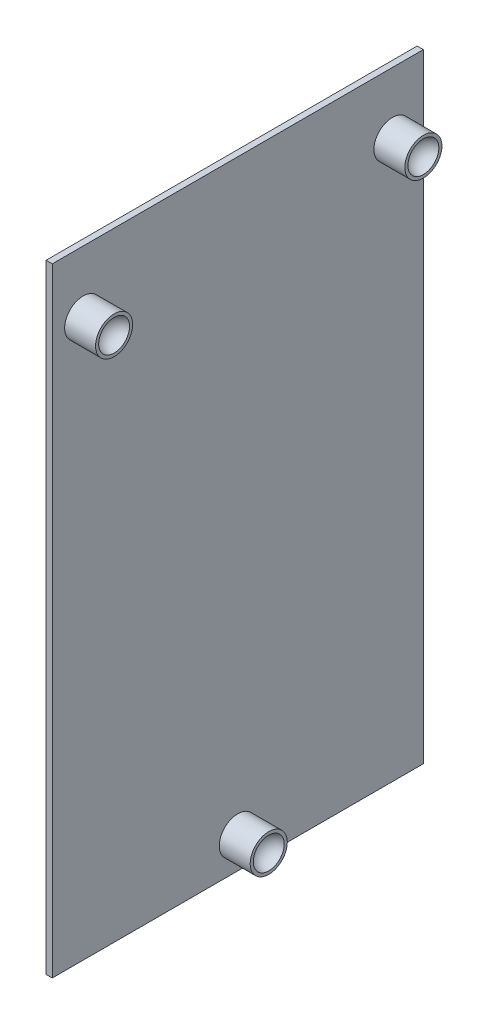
ISO-10303-21;
HEADER;
FILE_DESCRIPTION(('STEP AP214'),'2;1');
FILE_NAME('part.step','',(''),(''),'','','');
FILE_SCHEMA(('AUTOMOTIVE_DESIGN { 1 0 10303 214 1 1 1 1 }'));
ENDSEC;
DATA;
#1=APPLICATION_CONTEXT('core data for automotive mechanical design processes');
#2=APPLICATION_PROTOCOL_DEFINITION('international standard','automotive_design',2000,#1);
#3=PRODUCT_CONTEXT('',#1,'mechanical');
#4=PRODUCT('Part','Part','',(#3));
#5=PRODUCT_RELATED_PRODUCT_CATEGORY('part','',(#4));
#6=PRODUCT_DEFINITION_FORMATION('','',#4);
#7=PRODUCT_DEFINITION_CONTEXT('part definition',#1,'design');
#8=PRODUCT_DEFINITION('design','',#6,#7);
#9=PRODUCT_DEFINITION_SHAPE('','',#8);
#10=(LENGTH_UNIT() NAMED_UNIT(*) SI_UNIT(.MILLI.,.METRE.));
#11=(NAMED_UNIT(*) PLANE_ANGLE_UNIT() SI_UNIT($,.RADIAN.));
#12=(NAMED_UNIT(*) SI_UNIT($,.STERADIAN.) SOLID_ANGLE_UNIT());
#13=UNCERTAINTY_MEASURE_WITH_UNIT(LENGTH_MEASURE(1.E-05),#10,'distance_accuracy_value','');
#14=(GEOMETRIC_REPRESENTATION_CONTEXT(3) GLOBAL_UNCERTAINTY_ASSIGNED_CONTEXT((#13)) GLOBAL_UNIT_ASSIGNED_CONTEXT((#10,
#11,#12)) REPRESENTATION_CONTEXT('',''));
#15=CARTESIAN_POINT('',(0.,0.,0.));
#16=DIRECTION('',(0.,0.,1.));
#17=DIRECTION('',(1.,0.,0.));
#18=AXIS2_PLACEMENT_3D('',#15,#16,#17);
#19=CARTESIAN_POINT('',(-20.,2000.,600.));
#20=DIRECTION('',(0.,0.,1.));
#21=DIRECTION('',(0.,-1.,0.));
#22=AXIS2_PLACEMENT_3D('',#19,#20,#21);
#23=PLANE('',#22);
#24=DIRECTION('',(0.,-1.,0.));
#25=VECTOR('',#24,1.);
#26=CARTESIAN_POINT('',(0.,2000.,600.));
#27=LINE('',#26,#25);
#28=CARTESIAN_POINT('',(0.,2000.,600.));
#29=VERTEX_POINT('',#28);
#30=CARTESIAN_POINT('',(0.,0.,600.));
#31=VERTEX_POINT('',#30);
#32=EDGE_CURVE('E100',#29,#31,#27,.T.);
#33=ORIENTED_EDGE('',*,*,#32,.F.);
#34=DIRECTION('',(1.,0.,0.));
#35=VECTOR('',#34,1.);
#36=CARTESIAN_POINT('',(-20.,2000.,600.));
#37=LINE('',#36,#35);
#38=CARTESIAN_POINT('',(-20.,2000.,600.));
#39=VERTEX_POINT('',#38);
#40=EDGE_CURVE('E48',#39,#29,#37,.T.);
#41=ORIENTED_EDGE('',*,*,#40,.F.);
#42=DIRECTION('',(0.,-1.,0.));
#43=VECTOR('',#42,1.);
#44=CARTESIAN_POINT('',(-20.,2000.,600.));
#45=LINE('',#44,#43);
#46=CARTESIAN_POINT('',(-20.,0.,600.));
#47=VERTEX_POINT('',#46);
#48=EDGE_CURVE('E93',#39,#47,#45,.T.);
#49=ORIENTED_EDGE('',*,*,#48,.T.);
#50=DIRECTION('',(1.,0.,0.));
#51=VECTOR('',#50,1.);
#52=CARTESIAN_POINT('',(-20.,0.,600.));
#53=LINE('',#52,#51);
#54=EDGE_CURVE('E76',#47,#31,#53,.T.);
#55=ORIENTED_EDGE('',*,*,#54,.T.);
#56=EDGE_LOOP('',(#33,#41,#49,#55));
#57=FACE_BOUND('',#56,.T.);
#58=ADVANCED_FACE('F32',(#57),#23,.T.);
#59=CARTESIAN_POINT('',(-20.,2000.,600.));
#60=DIRECTION('',(0.,1.,0.));
#61=DIRECTION('',(0.,0.,1.));
#62=AXIS2_PLACEMENT_3D('',#59,#60,#61);
#63=PLANE('',#62);
#64=DIRECTION('',(0.,0.,1.));
#65=VECTOR('',#64,1.);
#66=CARTESIAN_POINT('',(0.,2000.,600.));
#67=LINE('',#66,#65);
#68=CARTESIAN_POINT('',(0.,2000.,-600.));
#69=VERTEX_POINT('',#68);
#70=EDGE_CURVE('E95',#69,#29,#67,.T.);
#71=ORIENTED_EDGE('',*,*,#70,.F.);
#72=DIRECTION('',(1.,0.,0.));
#73=VECTOR('',#72,1.);
#74=CARTESIAN_POINT('',(-20.,2000.,-600.));
#75=LINE('',#74,#73);
#76=CARTESIAN_POINT('',(-20.,2000.,-600.));
#77=VERTEX_POINT('',#76);
#78=EDGE_CURVE('E65',#77,#69,#75,.T.);
#79=ORIENTED_EDGE('',*,*,#78,.F.);
#80=DIRECTION('',(0.,0.,1.));
#81=VECTOR('',#80,1.);
#82=CARTESIAN_POINT('',(-20.,2000.,600.));
#83=LINE('',#82,#81);
#84=EDGE_CURVE('E90',#77,#39,#83,.T.);
#85=ORIENTED_EDGE('',*,*,#84,.T.);
#86=ORIENTED_EDGE('',*,*,#40,.T.);
#87=EDGE_LOOP('',(#71,#79,#85,#86));
#88=FACE_BOUND('',#87,.T.);
#89=ADVANCED_FACE('F127',(#88),#63,.T.);
#90=CARTESIAN_POINT('',(-20.,2000.,-600.));
#91=DIRECTION('',(0.,0.,-1.));
#92=DIRECTION('',(0.,1.,0.));
#93=AXIS2_PLACEMENT_3D('',#90,#91,#92);
#94=PLANE('',#93);
#95=DIRECTION('',(0.,1.,0.));
#96=VECTOR('',#95,1.);
#97=CARTESIAN_POINT('',(0.,2000.,-600.));
#98=LINE('',#97,#96);
#99=CARTESIAN_POINT('',(0.,0.,-600.));
#100=VERTEX_POINT('',#99);
#101=EDGE_CURVE('E84',#100,#69,#98,.T.);
#102=ORIENTED_EDGE('',*,*,#101,.F.);
#103=DIRECTION('',(1.,0.,0.));
#104=VECTOR('',#103,1.);
#105=CARTESIAN_POINT('',(-20.,0.,-600.));
#106=LINE('',#105,#104);
#107=CARTESIAN_POINT('',(-20.,0.,-600.));
#108=VERTEX_POINT('',#107);
#109=EDGE_CURVE('E79',#108,#100,#106,.T.);
#110=ORIENTED_EDGE('',*,*,#109,.F.);
#111=DIRECTION('',(0.,1.,0.));
#112=VECTOR('',#111,1.);
#113=CARTESIAN_POINT('',(-20.,2000.,-600.));
#114=LINE('',#113,#112);
#115=EDGE_CURVE('E82',#108,#77,#114,.T.);
#116=ORIENTED_EDGE('',*,*,#115,.T.);
#117=ORIENTED_EDGE('',*,*,#78,.T.);
#118=EDGE_LOOP('',(#102,#110,#116,#117));
#119=FACE_BOUND('',#118,.T.);
#120=ADVANCED_FACE('F81',(#119),#94,.T.);
#121=CARTESIAN_POINT('',(-20.,0.,600.));
#122=DIRECTION('',(0.,-1.,0.));
#123=DIRECTION('',(0.,0.,-1.));
#124=AXIS2_PLACEMENT_3D('',#121,#122,#123);
#125=PLANE('',#124);
#126=DIRECTION('',(0.,0.,-1.));
#127=VECTOR('',#126,1.);
#128=CARTESIAN_POINT('',(0.,0.,600.));
#129=LINE('',#128,#127);
#130=EDGE_CURVE('E103',#31,#100,#129,.T.);
#131=ORIENTED_EDGE('',*,*,#130,.F.);
#132=ORIENTED_EDGE('',*,*,#54,.F.);
#133=DIRECTION('',(0.,0.,-1.));
#134=VECTOR('',#133,1.);
#135=CARTESIAN_POINT('',(-20.,0.,600.));
#136=LINE('',#135,#134);
#137=EDGE_CURVE('E89',#47,#108,#136,.T.);
#138=ORIENTED_EDGE('',*,*,#137,.T.);
#139=ORIENTED_EDGE('',*,*,#109,.T.);
#140=EDGE_LOOP('',(#131,#132,#138,#139));
#141=FACE_BOUND('',#140,.T.);
#142=ADVANCED_FACE('F92',(#141),#125,.T.);
#143=CARTESIAN_POINT('',(-20.,0.,0.));
#144=DIRECTION('',(1.,0.,0.));
#145=DIRECTION('',(0.,0.,-1.));
#146=AXIS2_PLACEMENT_3D('',#143,#144,#145);
#147=PLANE('',#146);
#148=ORIENTED_EDGE('',*,*,#48,.F.);
#149=ORIENTED_EDGE('',*,*,#84,.F.);
#150=ORIENTED_EDGE('',*,*,#115,.F.);
#151=ORIENTED_EDGE('',*,*,#137,.F.);
#152=EDGE_LOOP('',(#148,#149,#150,#151));
#153=FACE_BOUND('',#152,.T.);
#154=ADVANCED_FACE('F88',(#153),#147,.F.);
#155=CARTESIAN_POINT('',(0.,0.,0.));
#156=DIRECTION('',(1.,0.,0.));
#157=DIRECTION('',(0.,0.,-1.));
#158=AXIS2_PLACEMENT_3D('',#155,#156,#157);
#159=PLANE('',#158);
#160=CARTESIAN_POINT('',(0.,1800.,-500.));
#161=DIRECTION('',(1.,0.,0.));
#162=DIRECTION('',(0.,0.,-1.));
#163=AXIS2_PLACEMENT_3D('',#160,#161,#162);
#164=CIRCLE('',#163,60.0000000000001);
#165=CARTESIAN_POINT('',(0.,1800.,-560.));
#166=VERTEX_POINT('',#165);
#167=EDGE_CURVE('E11',#166,#166,#164,.T.);
#168=ORIENTED_EDGE('',*,*,#167,.F.);
#169=EDGE_LOOP('',(#168));
#170=FACE_BOUND('',#169,.T.);
#171=CARTESIAN_POINT('',(0.,1800.,500.));
#172=DIRECTION('',(1.,0.,0.));
#173=DIRECTION('',(0.,0.,-1.));
#174=AXIS2_PLACEMENT_3D('',#171,#172,#173);
#175=CIRCLE('',#174,60.0000000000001);
#176=CARTESIAN_POINT('',(0.,1800.,440.));
#177=VERTEX_POINT('',#176);
#178=EDGE_CURVE('E40',#177,#177,#175,.T.);
#179=ORIENTED_EDGE('',*,*,#178,.F.);
#180=EDGE_LOOP('',(#179));
#181=FACE_BOUND('',#180,.T.);
#182=CARTESIAN_POINT('',(0.,100.,0.));
#183=DIRECTION('',(1.,0.,0.));
#184=DIRECTION('',(0.,0.,-1.));
#185=AXIS2_PLACEMENT_3D('',#182,#183,#184);
#186=CIRCLE('',#185,60.);
#187=CARTESIAN_POINT('',(0.,100.,-60.));
#188=VERTEX_POINT('',#187);
#189=EDGE_CURVE('E110',#188,#188,#186,.T.);
#190=ORIENTED_EDGE('',*,*,#189,.F.);
#191=EDGE_LOOP('',(#190));
#192=FACE_BOUND('',#191,.T.);
#193=ORIENTED_EDGE('',*,*,#32,.T.);
#194=ORIENTED_EDGE('',*,*,#130,.T.);
#195=ORIENTED_EDGE('',*,*,#101,.T.);
#196=ORIENTED_EDGE('',*,*,#70,.T.);
#197=EDGE_LOOP('',(#193,#194,#195,#196));
#198=FACE_BOUND('',#197,.T.);
#199=ADVANCED_FACE('F119',(#170,#181,#192,#198),#159,.T.);
#200=CARTESIAN_POINT('',(0.,100.,0.));
#201=DIRECTION('',(-1.,0.,0.));
#202=DIRECTION('',(0.,-1.,0.));
#203=AXIS2_PLACEMENT_3D('',#200,#201,#202);
#204=CYLINDRICAL_SURFACE('',#203,60.);
#205=CARTESIAN_POINT('',(100.,100.,0.));
#206=DIRECTION('',(-1.,0.,0.));
#207=DIRECTION('',(0.,-1.,0.));
#208=AXIS2_PLACEMENT_3D('',#205,#206,#207);
#209=CIRCLE('',#208,60.);
#210=CARTESIAN_POINT('',(100.,40.,0.));
#211=VERTEX_POINT('',#210);
#212=EDGE_CURVE('E104',#211,#211,#209,.T.);
#213=ORIENTED_EDGE('',*,*,#212,.T.);
#214=EDGE_LOOP('',(#213));
#215=FACE_BOUND('',#214,.T.);
#216=ORIENTED_EDGE('',*,*,#189,.T.);
#217=EDGE_LOOP('',(#216));
#218=FACE_BOUND('',#217,.T.);
#219=ADVANCED_FACE('F122',(#215,#218),#204,.T.);
#220=CARTESIAN_POINT('',(100.,50.,0.));
#221=DIRECTION('',(1.,0.,0.));
#222=DIRECTION('',(0.,1.,0.));
#223=AXIS2_PLACEMENT_3D('',#220,#221,#222);
#224=PLANE('',#223);
#225=CARTESIAN_POINT('',(100.,100.,0.));
#226=DIRECTION('',(-1.,0.,0.));
#227=DIRECTION('',(0.,-1.,0.));
#228=AXIS2_PLACEMENT_3D('',#225,#226,#227);
#229=CIRCLE('',#228,50.);
#230=CARTESIAN_POINT('',(100.,50.,0.));
#231=VERTEX_POINT('',#230);
#232=EDGE_CURVE('E192',#231,#231,#229,.T.);
#233=ORIENTED_EDGE('',*,*,#232,.T.);
#234=EDGE_LOOP('',(#233));
#235=FACE_BOUND('',#234,.T.);
#236=ORIENTED_EDGE('',*,*,#212,.F.);
#237=EDGE_LOOP('',(#236));
#238=FACE_BOUND('',#237,.T.);
#239=ADVANCED_FACE('F145',(#235,#238),#224,.T.);
#240=CARTESIAN_POINT('',(100.,100.,0.));
#241=DIRECTION('',(-1.,0.,0.));
#242=DIRECTION('',(0.,-1.,0.));
#243=AXIS2_PLACEMENT_3D('',#240,#241,#242);
#244=SPHERICAL_SURFACE('',#243,50.);
#245=ORIENTED_EDGE('',*,*,#232,.F.);
#246=EDGE_LOOP('',(#245));
#247=FACE_BOUND('',#246,.T.);
#248=ADVANCED_FACE('F149',(#247),#244,.F.);
#249=CARTESIAN_POINT('',(0.,1800.,500.));
#250=DIRECTION('',(-1.,0.,0.));
#251=DIRECTION('',(0.,0.,1.));
#252=AXIS2_PLACEMENT_3D('',#249,#250,#251);
#253=CYLINDRICAL_SURFACE('',#252,60.0000000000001);
#254=CARTESIAN_POINT('',(100.,1800.,500.));
#255=DIRECTION('',(-1.,0.,0.));
#256=DIRECTION('',(0.,0.,1.));
#257=AXIS2_PLACEMENT_3D('',#254,#255,#256);
#258=CIRCLE('',#257,60.0000000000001);
#259=CARTESIAN_POINT('',(100.,1800.,560.));
#260=VERTEX_POINT('',#259);
#261=EDGE_CURVE('E189',#260,#260,#258,.T.);
#262=ORIENTED_EDGE('',*,*,#261,.T.);
#263=EDGE_LOOP('',(#262));
#264=FACE_BOUND('',#263,.T.);
#265=ORIENTED_EDGE('',*,*,#178,.T.);
#266=EDGE_LOOP('',(#265));
#267=FACE_BOUND('',#266,.T.);
#268=ADVANCED_FACE('F117',(#264,#267),#253,.T.);
#269=CARTESIAN_POINT('',(100.,1750.,500.));
#270=DIRECTION('',(1.,0.,0.));
#271=DIRECTION('',(0.,0.,-1.));
#272=AXIS2_PLACEMENT_3D('',#269,#270,#271);
#273=PLANE('',#272);
#274=CARTESIAN_POINT('',(100.,1800.,500.));
#275=DIRECTION('',(-1.,0.,0.));
#276=DIRECTION('',(0.,0.,1.));
#277=AXIS2_PLACEMENT_3D('',#274,#275,#276);
#278=CIRCLE('',#277,50.);
#279=CARTESIAN_POINT('',(100.,1800.,550.));
#280=VERTEX_POINT('',#279);
#281=EDGE_CURVE('E184',#280,#280,#278,.T.);
#282=ORIENTED_EDGE('',*,*,#281,.T.);
#283=EDGE_LOOP('',(#282));
#284=FACE_BOUND('',#283,.T.);
#285=ORIENTED_EDGE('',*,*,#261,.F.);
#286=EDGE_LOOP('',(#285));
#287=FACE_BOUND('',#286,.T.);
#288=ADVANCED_FACE('F156',(#284,#287),#273,.T.);
#289=CARTESIAN_POINT('',(100.,1800.,500.));
#290=DIRECTION('',(-1.,0.,0.));
#291=DIRECTION('',(0.,-1.,0.));
#292=AXIS2_PLACEMENT_3D('',#289,#290,#291);
#293=SPHERICAL_SURFACE('',#292,50.);
#294=ORIENTED_EDGE('',*,*,#281,.F.);
#295=EDGE_LOOP('',(#294));
#296=FACE_BOUND('',#295,.T.);
#297=ADVANCED_FACE('F160',(#296),#293,.F.);
#298=CARTESIAN_POINT('',(0.,1800.,-500.));
#299=DIRECTION('',(-1.,0.,0.));
#300=DIRECTION('',(0.,0.,-1.));
#301=AXIS2_PLACEMENT_3D('',#298,#299,#300);
#302=CYLINDRICAL_SURFACE('',#301,60.0000000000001);
#303=CARTESIAN_POINT('',(100.,1800.,-500.));
#304=DIRECTION('',(1.,0.,0.));
#305=DIRECTION('',(0.,0.,-1.));
#306=AXIS2_PLACEMENT_3D('',#303,#304,#305);
#307=CIRCLE('',#306,60.0000000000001);
#308=CARTESIAN_POINT('',(100.,1800.,-560.));
#309=VERTEX_POINT('',#308);
#310=EDGE_CURVE('E181',#309,#309,#307,.T.);
#311=ORIENTED_EDGE('',*,*,#310,.F.);
#312=EDGE_LOOP('',(#311));
#313=FACE_BOUND('',#312,.T.);
#314=ORIENTED_EDGE('',*,*,#167,.T.);
#315=EDGE_LOOP('',(#314));
#316=FACE_BOUND('',#315,.T.);
#317=ADVANCED_FACE('F164',(#313,#316),#302,.T.);
#318=CARTESIAN_POINT('',(100.,1750.,-500.));
#319=DIRECTION('',(1.,0.,0.));
#320=DIRECTION('',(0.,0.,1.));
#321=AXIS2_PLACEMENT_3D('',#318,#319,#320);
#322=PLANE('',#321);
#323=CARTESIAN_POINT('',(100.,1800.,-500.));
#324=DIRECTION('',(1.,0.,0.));
#325=DIRECTION('',(0.,0.,-1.));
#326=AXIS2_PLACEMENT_3D('',#323,#324,#325);
#327=CIRCLE('',#326,50.);
#328=CARTESIAN_POINT('',(100.,1800.,-550.));
#329=VERTEX_POINT('',#328);
#330=EDGE_CURVE('E180',#329,#329,#327,.T.);
#331=ORIENTED_EDGE('',*,*,#330,.F.);
#332=EDGE_LOOP('',(#331));
#333=FACE_BOUND('',#332,.T.);
#334=ORIENTED_EDGE('',*,*,#310,.T.);
#335=EDGE_LOOP('',(#334));
#336=FACE_BOUND('',#335,.T.);
#337=ADVANCED_FACE('F168',(#333,#336),#322,.T.);
#338=CARTESIAN_POINT('',(100.,1800.,-500.));
#339=DIRECTION('',(-1.,0.,0.));
#340=DIRECTION('',(0.,-1.,0.));
#341=AXIS2_PLACEMENT_3D('',#338,#339,#340);
#342=SPHERICAL_SURFACE('',#341,50.);
#343=ORIENTED_EDGE('',*,*,#330,.T.);
#344=EDGE_LOOP('',(#343));
#345=FACE_BOUND('',#344,.T.);
#346=ADVANCED_FACE('F172',(#345),#342,.F.);
#347=CLOSED_SHELL('',(#58,#89,#120,#142,#154,#199,#219,#239,#248,#268,#288,#297,#317,#337,#346));
#348=MANIFOLD_SOLID_BREP('B2',#347);
#349=ADVANCED_BREP_SHAPE_REPRESENTATION('',(#18,#348),#14);
#350=SHAPE_DEFINITION_REPRESENTATION(#9,#349);
ENDSEC;
END-ISO-10303-21;
